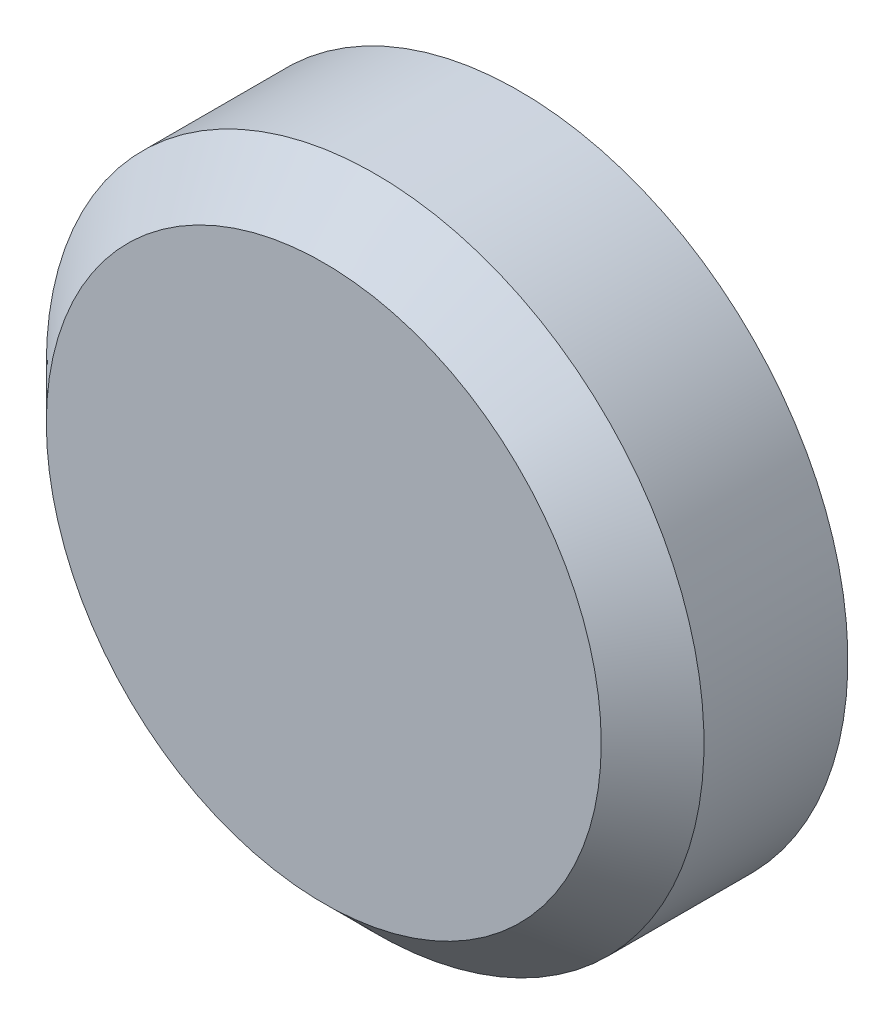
from build123d import *

# Parameters (mm, degrees)
ESQUISSE1_R          = 3.2
BASE_EXTRUSION_DEPTH = 1.9
CHANFREIN1_SIZE      = 0.5


with BuildPart() as part:
    # Esquisse1 → Base-Extrusion (new body)
    with BuildSketch(Plane.XY):
        with Locations(Location((0, 0, 0), (0, 0, 180))):
            Circle(ESQUISSE1_R)
    extrude(amount=BASE_EXTRUSION_DEPTH)

    # Chanfrein1
    chanfrein1_edges = [part.edges().sort_by_distance(p)[0] for p in [
        (3.2, 0, 1.9),
    ]]
    chamfer(chanfrein1_edges, length=CHANFREIN1_SIZE)


solid = part.part
